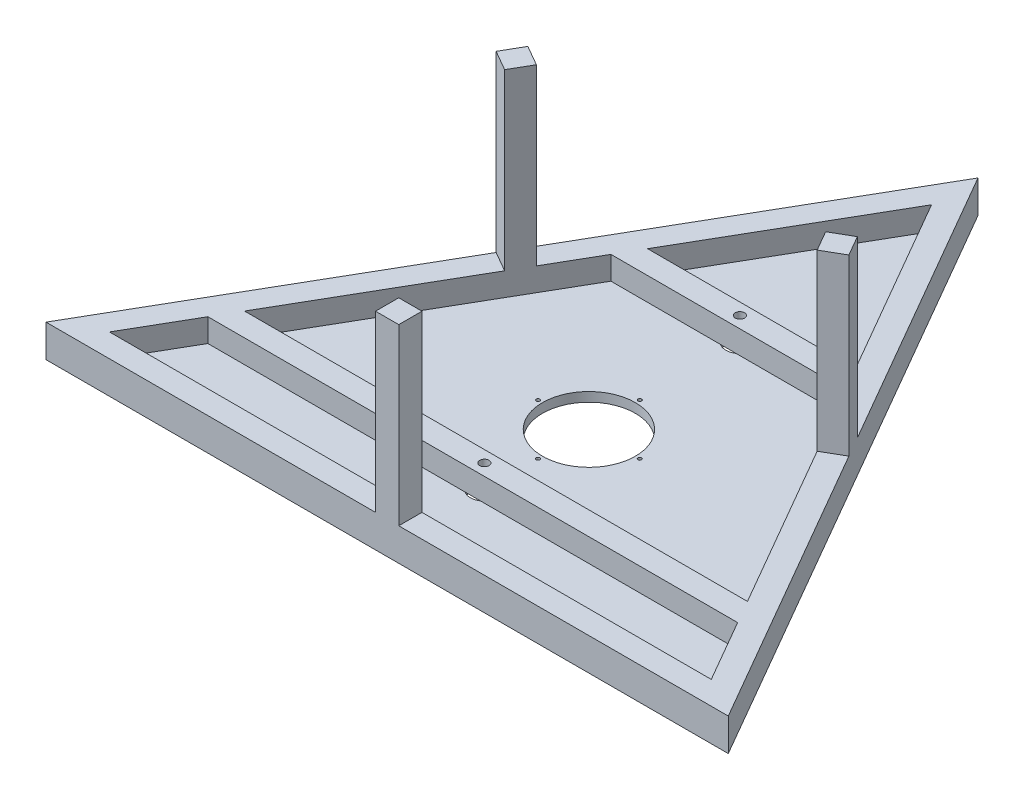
from build123d import *

# Parameters (mm, degrees)
SKETCH_1_R          = 4
EXTRUDE_1_DEPTH     = 20
SKETCH_2_W          = 20
SKETCH_2_H          = 20
EXTRUDE_2_DEPTH     = 150
SKETCH_3_R          = 40
SKETCH_3_R_2        = 12
EXTRUDE_3_DEPTH     = 8
SKETCH_4_R          = 1.55
CUT_EXTRUDE_1_DEPTH = 8


with BuildPart() as part:
    # Sketch 1 → Extrude 1 (new body)
    with BuildSketch(Plane(origin=(0, 0, 0), x_dir=(1, 0, 0), z_dir=(0, 1, 0))):
        Polygon((293.708348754, -213.717782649), (0, 295), (-293.708348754, -213.717782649), align=None)
        with Locations(Location((0, 90, 0), (0, 0, 270))):
            Circle(SKETCH_1_R, mode=Mode.SUBTRACT)
        with Locations(Location((0, -130, 0), (0, 0, 270))):
            Circle(SKETCH_1_R, mode=Mode.SUBTRACT)
        Polygon((259.067332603, -193.717782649), (228.05335633, -140), (-228.05335633, -140), (-259.067332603, -193.717782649), align=None, mode=Mode.SUBTRACT)
        Polygon((0, 255), (-89.489291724, 100), (89.489291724, 100), align=None, mode=Mode.SUBTRACT)
        Polygon((-101.036297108, 80), (101.036297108, 80), (216.506350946, -120), (-216.506350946, -120), align=None, mode=Mode.SUBTRACT)
    extrude(amount=EXTRUDE_1_DEPTH)

    # Sketch 2 → Extrude 2 (add)
    with BuildSketch(Plane(origin=(0, 20, 0), x_dir=(1, 0, 0), z_dir=(0, 1, 0))):
        Polygon((-141.854174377, 49.301362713), (-151.854174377, 31.980854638), (-134.533666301, 21.980854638), (-124.533666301, 39.301362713), align=None)
        with Locations((0, -203.717782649)):
            Rectangle(SKETCH_2_W, SKETCH_2_H)
        Polygon((141.854174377, 49.301362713), (124.533666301, 39.301362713), (134.533666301, 21.980854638), (151.854174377, 31.980854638), align=None)
    extrude(amount=EXTRUDE_2_DEPTH)

    # Sketch 3 → Extrude 3 (add)
    with BuildSketch(Plane.XZ):
        Polygon((0, -295), (-293.708348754, 213.717782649), (293.708348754, 213.717782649), align=None)
        with Locations(Location((0, 40, 0), (0, 0, 270))):
            Circle(SKETCH_3_R, mode=Mode.SUBTRACT)
        with Locations(Location((0, 130, 0), (0, 0, 123.557309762))):
            Circle(SKETCH_3_R_2, mode=Mode.SUBTRACT)
        with Locations(Location((0, -90, 0), (0, 0, 123.557309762))):
            Circle(SKETCH_3_R_2, mode=Mode.SUBTRACT)
    extrude(amount=EXTRUDE_3_DEPTH)

    # Sketch 4 → Cut-Extrude 1 (cut)
    with BuildSketch(Plane.XZ.offset(8)):
        with Locations(Location((43.8, 40, 0), (0, 0, 270))):
            Circle(SKETCH_4_R)
        with Locations(Location((0, -3.8, 0), (0, 0, 270))):
            Circle(SKETCH_4_R)
        with Locations(Location((-43.8, 40, 0), (0, 0, 270))):
            Circle(SKETCH_4_R)
        with Locations(Location((0, 83.8, 0), (0, 0, 270))):
            Circle(SKETCH_4_R)
    extrude(amount=-CUT_EXTRUDE_1_DEPTH, mode=Mode.SUBTRACT)


solid = part.part
